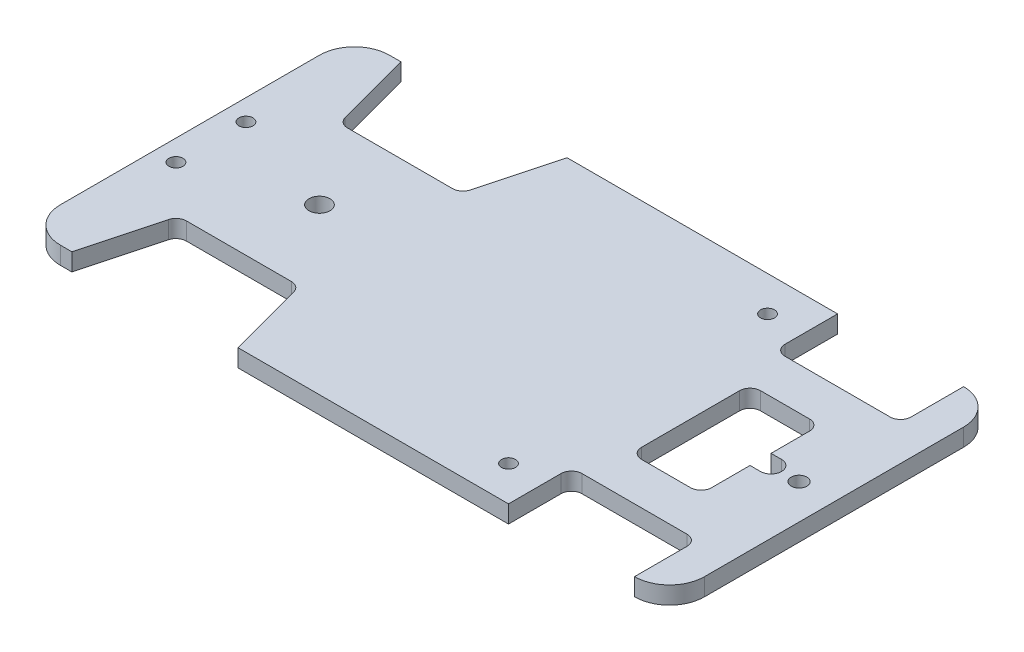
from build123d import *

# Parameters (mm, degrees)
SKETCH1_R      = 2.25
SKETCH1_R_2    = 3
SKETCH1_R_3    = 2
EXTRUDE1_DEPTH = 5


with BuildPart() as part:
    # Sketch1 → Extrude1 (new body)
    with BuildSketch(Plane(origin=(0, 0, 0), x_dir=(1, 0, 0), z_dir=(0, 1, 0))):
        with BuildLine():
            Line((0, -37), (0, 37))
            ThreePointArc((0, 37), (2.928932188, 44.071067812), (10, 47))
            Line((10, 47), (13.267238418, 47))
            Line((13.267238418, 47), (19.102222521, 25.223542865))
            ThreePointArc((19.102222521, 25.223542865), (20.173715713, 23.619939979), (22, 23))
            Line((22, 23), (52, 23))
            ThreePointArc((52, 23), (53.826284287, 23.619939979), (54.897777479, 25.223542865))
            Line((54.897777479, 25.223542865), (60.732761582, 47))
            Line((60.732761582, 47), (138, 47))
            Line((138, 47), (138, 32))
            ThreePointArc((138, 32), (138.878679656, 29.878679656), (141, 29))
            Line((141, 29), (171, 29))
            ThreePointArc((171, 29), (173.121320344, 29.878679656), (174, 32))
            Line((174, 32), (174, 47))
            ThreePointArc((174, 47), (181.071067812, 44.071067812), (184, 37))
            Line((184, 37), (184, -37))
            ThreePointArc((184, -37), (181.071067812, -44.071067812), (174, -47))
            Line((174, -47), (174, -32))
            ThreePointArc((174, -32), (173.121320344, -29.878679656), (171, -29))
            Line((171, -29), (141, -29))
            ThreePointArc((141, -29), (138.878679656, -29.878679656), (138, -32))
            Line((138, -32), (138, -47))
            Line((138, -47), (60.732761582, -47))
            Line((60.732761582, -47), (54.897777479, -25.223542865))
            ThreePointArc((54.897777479, -25.223542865), (53.826284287, -23.619939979), (52, -23))
            Line((52, -23), (22, -23))
            ThreePointArc((22, -23), (20.173715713, -23.619939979), (19.102222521, -25.223542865))
            Line((19.102222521, -25.223542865), (13.267238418, -47))
            Line((13.267238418, -47), (10, -47))
            ThreePointArc((10, -47), (2.928932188, -44.071067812), (0, -37))
        make_face()
        with Locations(Location((174, 0, 0), (0, 0, 270))):
            Circle(SKETCH1_R, mode=Mode.SUBTRACT)
        with Locations(Location((37, 0, 0), (0, 0, 270))):
            Circle(SKETCH1_R_2, mode=Mode.SUBTRACT)
        with Locations(Location((6, 10, 0), (0, 0, 270))):
            Circle(SKETCH1_R_3, mode=Mode.SUBTRACT)
        with Locations(Location((6, -10, 0), (0, 0, 90))):
            Circle(SKETCH1_R_3, mode=Mode.SUBTRACT)
        with Locations(Location((128, 37, 0), (0, 0, 270))):
            Circle(SKETCH1_R_3, mode=Mode.SUBTRACT)
        with Locations(Location((128, -37, 0), (0, 0, 90))):
            Circle(SKETCH1_R_3, mode=Mode.SUBTRACT)
        with BuildLine():
            Line((166, 3), (163, 3))
            Line((163, 3), (163, 14))
            ThreePointArc((163, 14), (162.121320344, 16.121320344), (160, 17))
            Line((160, 17), (146, 17))
            ThreePointArc((146, 17), (143.878679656, 16.121320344), (143, 14))
            Line((143, 14), (143, -14))
            ThreePointArc((143, -14), (143.878679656, -16.121320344), (146, -17))
            Line((146, -17), (160, -17))
            ThreePointArc((160, -17), (162.121320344, -16.121320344), (163, -14))
            Line((163, -14), (163, -3))
            Line((163, -3), (166, -3))
            ThreePointArc((166, -3), (169, 0), (166, 3))
        make_face(mode=Mode.SUBTRACT)
    extrude(amount=EXTRUDE1_DEPTH)


solid = part.part
